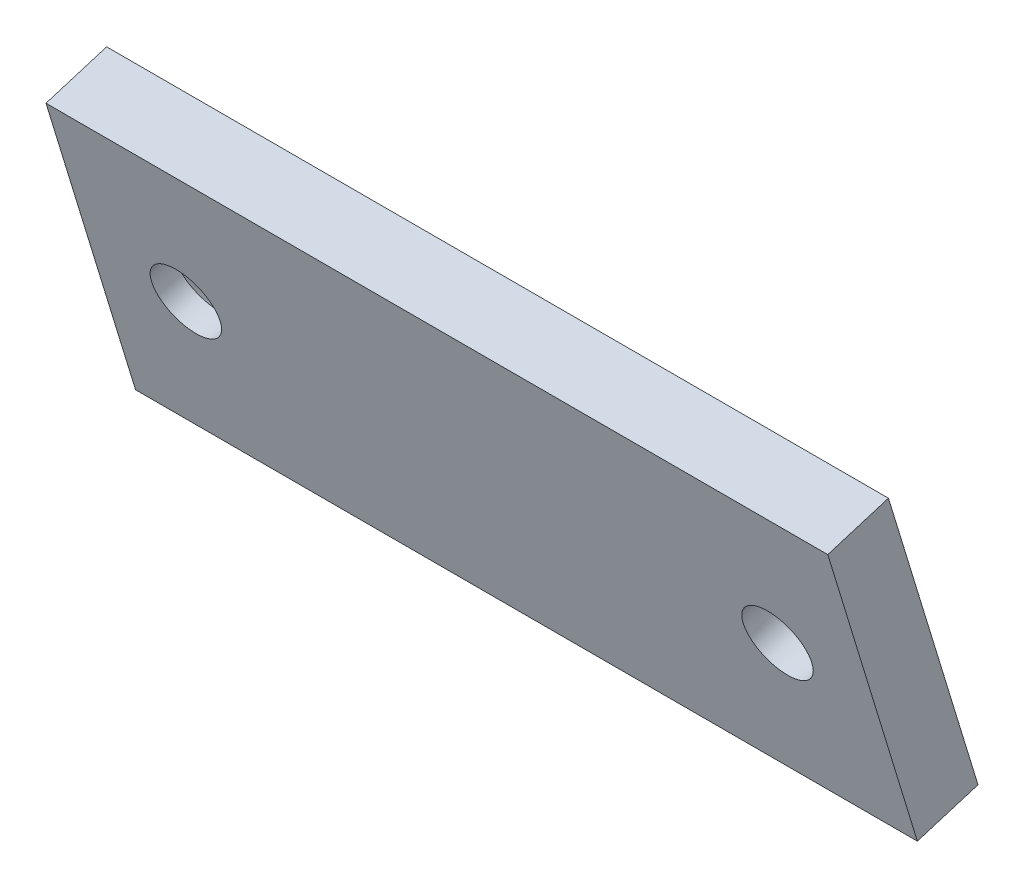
ISO-10303-21;
HEADER;
FILE_DESCRIPTION(('STEP AP214'),'2;1');
FILE_NAME('part.step','',(''),(''),'','','');
FILE_SCHEMA(('AUTOMOTIVE_DESIGN { 1 0 10303 214 1 1 1 1 }'));
ENDSEC;
DATA;
#1=APPLICATION_CONTEXT('core data for automotive mechanical design processes');
#2=APPLICATION_PROTOCOL_DEFINITION('international standard','automotive_design',2000,#1);
#3=PRODUCT_CONTEXT('',#1,'mechanical');
#4=PRODUCT('Part','Part','',(#3));
#5=PRODUCT_RELATED_PRODUCT_CATEGORY('part','',(#4));
#6=PRODUCT_DEFINITION_FORMATION('','',#4);
#7=PRODUCT_DEFINITION_CONTEXT('part definition',#1,'design');
#8=PRODUCT_DEFINITION('design','',#6,#7);
#9=PRODUCT_DEFINITION_SHAPE('','',#8);
#10=(LENGTH_UNIT() NAMED_UNIT(*) SI_UNIT(.MILLI.,.METRE.));
#11=(NAMED_UNIT(*) PLANE_ANGLE_UNIT() SI_UNIT($,.RADIAN.));
#12=(NAMED_UNIT(*) SI_UNIT($,.STERADIAN.) SOLID_ANGLE_UNIT());
#13=UNCERTAINTY_MEASURE_WITH_UNIT(LENGTH_MEASURE(1.E-05),#10,'distance_accuracy_value','');
#14=(GEOMETRIC_REPRESENTATION_CONTEXT(3) GLOBAL_UNCERTAINTY_ASSIGNED_CONTEXT((#13)) GLOBAL_UNIT_ASSIGNED_CONTEXT((#10,
#11,#12)) REPRESENTATION_CONTEXT('',''));
#15=CARTESIAN_POINT('',(0.,0.,0.));
#16=DIRECTION('',(0.,0.,1.));
#17=DIRECTION('',(1.,0.,0.));
#18=AXIS2_PLACEMENT_3D('',#15,#16,#17);
#19=CARTESIAN_POINT('',(-28.,-1.40281228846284,-68.5550265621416));
#20=DIRECTION('',(0.,0.292371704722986,-0.956304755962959));
#21=DIRECTION('',(0.,0.956304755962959,0.292371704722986));
#22=AXIS2_PLACEMENT_3D('',#19,#20,#21);
#23=CONICAL_SURFACE('',#22,3.25,0.785398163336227);
#24=CARTESIAN_POINT('',(-28.,-1.40281228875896,-68.5550265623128));
#25=DIRECTION('',(0.,0.292371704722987,-0.956304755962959));
#26=DIRECTION('',(0.,0.956304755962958,0.29237170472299));
#27=AXIS2_PLACEMENT_3D('',#24,#25,#26);
#28=CIRCLE('',#27,3.24999999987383);
#29=CARTESIAN_POINT('',(-28.,1.705178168,-67.604818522));
#30=VERTEX_POINT('',#29);
#31=EDGE_CURVE('E82',#30,#30,#28,.T.);
#32=ORIENTED_EDGE('',*,*,#31,.F.);
#33=EDGE_LOOP('',(#32));
#34=FACE_BOUND('',#33,.T.);
#35=CARTESIAN_POINT('',(-28.,-0.56955293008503,-71.2804951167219));
#36=DIRECTION('',(0.,0.292371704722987,-0.956304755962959));
#37=DIRECTION('',(0.,0.956304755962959,0.292371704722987));
#38=AXIS2_PLACEMENT_3D('',#35,#36,#37);
#39=CIRCLE('',#38,6.09999999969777);
#40=CARTESIAN_POINT('',(-28.,5.263906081,-69.497027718));
#41=VERTEX_POINT('',#40);
#42=EDGE_CURVE('E117',#41,#41,#39,.F.);
#43=ORIENTED_EDGE('',*,*,#42,.F.);
#44=EDGE_LOOP('',(#43));
#45=FACE_BOUND('',#44,.T.);
#46=ADVANCED_FACE('F24',(#34,#45),#23,.F.);
#47=CARTESIAN_POINT('',(-28.,-0.569552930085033,-71.2804951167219));
#48=DIRECTION('',(0.,0.292371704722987,-0.956304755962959));
#49=DIRECTION('',(0.,0.956304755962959,0.292371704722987));
#50=AXIS2_PLACEMENT_3D('',#47,#48,#49);
#51=CYLINDRICAL_SURFACE('',#50,6.09999999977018);
#52=ORIENTED_EDGE('',*,*,#42,.T.);
#53=EDGE_LOOP('',(#52));
#54=FACE_BOUND('',#53,.T.);
#55=CARTESIAN_POINT('',(-28.,-0.335655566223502,-72.0455389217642));
#56=DIRECTION('',(0.,0.292371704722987,-0.956304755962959));
#57=DIRECTION('',(0.,0.956304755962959,0.292371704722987));
#58=AXIS2_PLACEMENT_3D('',#55,#56,#57);
#59=CIRCLE('',#58,6.09999999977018);
#60=CARTESIAN_POINT('',(-28.,5.49780344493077,-70.2620715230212));
#61=VERTEX_POINT('',#60);
#62=EDGE_CURVE('E100',#61,#61,#59,.F.);
#63=ORIENTED_EDGE('',*,*,#62,.F.);
#64=EDGE_LOOP('',(#63));
#65=FACE_BOUND('',#64,.T.);
#66=ADVANCED_FACE('F156',(#54,#65),#51,.F.);
#67=CARTESIAN_POINT('',(37.,15.179460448,-66.796978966));
#68=DIRECTION('',(1.,0.,0.));
#69=DIRECTION('',(0.,-0.559192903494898,0.829037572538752));
#70=AXIS2_PLACEMENT_3D('',#67,#68,#69);
#71=PLANE('',#70);
#72=DIRECTION('',(0.,0.956304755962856,0.292371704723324));
#73=VECTOR('',#72,1.);
#74=CARTESIAN_POINT('',(37.,-2.0898857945,-66.3077103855));
#75=LINE('',#74,#73);
#76=CARTESIAN_POINT('',(37.,-15.9563047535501,-70.5471001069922));
#77=VERTEX_POINT('',#76);
#78=CARTESIAN_POINT('',(37.,11.7765331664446,-62.068320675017));
#79=VERTEX_POINT('',#78);
#80=EDGE_CURVE('E102',#77,#79,#75,.T.);
#81=ORIENTED_EDGE('',*,*,#80,.F.);
#82=DIRECTION('',(0.,0.292371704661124,-0.956304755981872));
#83=VECTOR('',#82,1.);
#84=CARTESIAN_POINT('',(37.,-15.079189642,-73.416014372));
#85=LINE('',#84,#83);
#86=CARTESIAN_POINT('',(37.,-14.2020745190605,-76.2849286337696));
#87=VERTEX_POINT('',#86);
#88=EDGE_CURVE('E112',#77,#87,#85,.T.);
#89=ORIENTED_EDGE('',*,*,#88,.T.);
#90=DIRECTION('',(0.,-0.956304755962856,-0.292371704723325));
#91=VECTOR('',#90,1.);
#92=CARTESIAN_POINT('',(37.,-0.335655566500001,-72.0455389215));
#93=LINE('',#92,#91);
#94=CARTESIAN_POINT('',(37.,13.5307633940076,-67.8061492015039));
#95=VERTEX_POINT('',#94);
#96=EDGE_CURVE('E86',#95,#87,#93,.T.);
#97=ORIENTED_EDGE('',*,*,#96,.F.);
#98=DIRECTION('',(0.,0.292371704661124,-0.956304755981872));
#99=VECTOR('',#98,1.);
#100=CARTESIAN_POINT('',(37.,12.653648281,-64.937234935));
#101=LINE('',#100,#99);
#102=EDGE_CURVE('E75',#79,#95,#101,.T.);
#103=ORIENTED_EDGE('',*,*,#102,.F.);
#104=EDGE_LOOP('',(#81,#89,#97,#103));
#105=FACE_BOUND('',#104,.T.);
#106=ADVANCED_FACE('F159',(#105),#71,.T.);
#107=CARTESIAN_POINT('',(-37.,13.530763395,-67.806149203));
#108=DIRECTION('',(0.,0.956304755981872,0.292371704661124));
#109=DIRECTION('',(0.,-0.292371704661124,0.956304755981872));
#110=AXIS2_PLACEMENT_3D('',#107,#108,#109);
#111=PLANE('',#110);
#112=DIRECTION('',(0.,0.292371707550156,-0.956304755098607));
#113=VECTOR('',#112,1.);
#114=CARTESIAN_POINT('',(-37.,11.7765331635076,-62.0683206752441));
#115=LINE('',#114,#113);
#116=CARTESIAN_POINT('',(-37.,11.7765331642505,-62.0683206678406));
#117=VERTEX_POINT('',#116);
#118=CARTESIAN_POINT('',(-37.,13.5307634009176,-67.8061492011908));
#119=VERTEX_POINT('',#118);
#120=EDGE_CURVE('E28',#117,#119,#115,.T.);
#121=ORIENTED_EDGE('',*,*,#120,.F.);
#122=DIRECTION('',(-1.,0.,0.));
#123=VECTOR('',#122,1.);
#124=CARTESIAN_POINT('',(0.,11.776533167,-62.068320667));
#125=LINE('',#124,#123);
#126=EDGE_CURVE('E105',#79,#117,#125,.T.);
#127=ORIENTED_EDGE('',*,*,#126,.F.);
#128=ORIENTED_EDGE('',*,*,#102,.T.);
#129=DIRECTION('',(1.,0.,0.));
#130=VECTOR('',#129,1.);
#131=CARTESIAN_POINT('',(0.,13.530763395,-67.806149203));
#132=LINE('',#131,#130);
#133=EDGE_CURVE('E79',#119,#95,#132,.T.);
#134=ORIENTED_EDGE('',*,*,#133,.F.);
#135=EDGE_LOOP('',(#121,#127,#128,#134));
#136=FACE_BOUND('',#135,.T.);
#137=ADVANCED_FACE('F84',(#136),#111,.T.);
#138=CARTESIAN_POINT('',(-37.,7.134236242,-54.869443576));
#139=DIRECTION('',(-1.,0.,0.));
#140=DIRECTION('',(0.,0.559192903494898,-0.829037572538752));
#141=AXIS2_PLACEMENT_3D('',#138,#139,#140);
#142=PLANE('',#141);
#143=DIRECTION('',(0.,0.956304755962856,0.292371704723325));
#144=VECTOR('',#143,1.);
#145=CARTESIAN_POINT('',(-37.,-0.335655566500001,-72.0455389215));
#146=LINE('',#145,#144);
#147=CARTESIAN_POINT('',(-37.,-14.2020745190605,-76.2849286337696));
#148=VERTEX_POINT('',#147);
#149=EDGE_CURVE('E71',#148,#119,#146,.T.);
#150=ORIENTED_EDGE('',*,*,#149,.F.);
#151=DIRECTION('',(0.,-0.292371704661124,0.956304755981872));
#152=VECTOR('',#151,1.);
#153=CARTESIAN_POINT('',(-37.,-15.079189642,-73.416014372));
#154=LINE('',#153,#152);
#155=CARTESIAN_POINT('',(-37.,-15.9563047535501,-70.5471001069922));
#156=VERTEX_POINT('',#155);
#157=EDGE_CURVE('E63',#148,#156,#154,.T.);
#158=ORIENTED_EDGE('',*,*,#157,.T.);
#159=DIRECTION('',(0.,-0.956304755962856,-0.292371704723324));
#160=VECTOR('',#159,1.);
#161=CARTESIAN_POINT('',(-37.,-2.0898857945,-66.3077103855));
#162=LINE('',#161,#160);
#163=EDGE_CURVE('E43',#117,#156,#162,.T.);
#164=ORIENTED_EDGE('',*,*,#163,.F.);
#165=ORIENTED_EDGE('',*,*,#120,.T.);
#166=EDGE_LOOP('',(#150,#158,#164,#165));
#167=FACE_BOUND('',#166,.T.);
#168=ADVANCED_FACE('F70',(#167),#142,.T.);
#169=CARTESIAN_POINT('',(-37.,-14.202074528,-76.28492864));
#170=DIRECTION('',(0.,0.956304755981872,0.292371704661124));
#171=DIRECTION('',(0.,-0.292371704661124,0.956304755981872));
#172=AXIS2_PLACEMENT_3D('',#169,#170,#171);
#173=PLANE('',#172);
#174=DIRECTION('',(1.,0.,0.));
#175=VECTOR('',#174,1.);
#176=CARTESIAN_POINT('',(0.,-15.956304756,-70.547100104));
#177=LINE('',#176,#175);
#178=EDGE_CURVE('E99',#156,#77,#177,.T.);
#179=ORIENTED_EDGE('',*,*,#178,.F.);
#180=ORIENTED_EDGE('',*,*,#157,.F.);
#181=DIRECTION('',(-1.,0.,0.));
#182=VECTOR('',#181,1.);
#183=CARTESIAN_POINT('',(0.,-14.202074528,-76.28492864));
#184=LINE('',#183,#182);
#185=EDGE_CURVE('E81',#87,#148,#184,.T.);
#186=ORIENTED_EDGE('',*,*,#185,.F.);
#187=ORIENTED_EDGE('',*,*,#88,.F.);
#188=EDGE_LOOP('',(#179,#180,#186,#187));
#189=FACE_BOUND('',#188,.T.);
#190=ADVANCED_FACE('F154',(#189),#173,.F.);
#191=CARTESIAN_POINT('',(-28.,-2.08988579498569,-66.3077103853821));
#192=DIRECTION('',(0.,0.292371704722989,-0.956304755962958));
#193=DIRECTION('',(0.,0.956304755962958,0.292371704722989));
#194=AXIS2_PLACEMENT_3D('',#191,#192,#193);
#195=CYLINDRICAL_SURFACE('',#194,3.24999999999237);
#196=CARTESIAN_POINT('',(-28.,-2.08988579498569,-66.3077103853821));
#197=DIRECTION('',(0.,0.292371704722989,-0.956304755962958));
#198=DIRECTION('',(0.,0.956304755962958,0.292371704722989));
#199=AXIS2_PLACEMENT_3D('',#196,#197,#198);
#200=CIRCLE('',#199,3.24999999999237);
#201=CARTESIAN_POINT('',(-28.,1.01810466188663,-65.3575023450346));
#202=VERTEX_POINT('',#201);
#203=EDGE_CURVE('E97',#202,#202,#200,.T.);
#204=ORIENTED_EDGE('',*,*,#203,.F.);
#205=EDGE_LOOP('',(#204));
#206=FACE_BOUND('',#205,.T.);
#207=ORIENTED_EDGE('',*,*,#31,.T.);
#208=EDGE_LOOP('',(#207));
#209=FACE_BOUND('',#208,.T.);
#210=ADVANCED_FACE('F145',(#206,#209),#195,.F.);
#211=CARTESIAN_POINT('',(-37.,13.530763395,-67.806149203));
#212=DIRECTION('',(0.,0.292371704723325,-0.956304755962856));
#213=DIRECTION('',(1.,0.,0.));
#214=AXIS2_PLACEMENT_3D('',#211,#212,#213);
#215=PLANE('',#214);
#216=ORIENTED_EDGE('',*,*,#62,.T.);
#217=EDGE_LOOP('',(#216));
#218=FACE_BOUND('',#217,.T.);
#219=CARTESIAN_POINT('',(28.,-0.335655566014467,-72.0455389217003));
#220=DIRECTION('',(0.,0.292371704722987,-0.956304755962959));
#221=DIRECTION('',(0.,0.956304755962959,0.292371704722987));
#222=AXIS2_PLACEMENT_3D('',#219,#220,#221);
#223=CIRCLE('',#222,6.09999999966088);
#224=CARTESIAN_POINT('',(28.,5.49780344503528,-70.2620715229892));
#225=VERTEX_POINT('',#224);
#226=EDGE_CURVE('E94',#225,#225,#223,.T.);
#227=ORIENTED_EDGE('',*,*,#226,.F.);
#228=EDGE_LOOP('',(#227));
#229=FACE_BOUND('',#228,.T.);
#230=ORIENTED_EDGE('',*,*,#96,.T.);
#231=ORIENTED_EDGE('',*,*,#185,.T.);
#232=ORIENTED_EDGE('',*,*,#149,.T.);
#233=ORIENTED_EDGE('',*,*,#133,.T.);
#234=EDGE_LOOP('',(#230,#231,#232,#233));
#235=FACE_BOUND('',#234,.T.);
#236=ADVANCED_FACE('F78',(#218,#229,#235),#215,.T.);
#237=CARTESIAN_POINT('',(-37.,-15.956304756,-70.547100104));
#238=DIRECTION('',(0.,-0.292371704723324,0.956304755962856));
#239=DIRECTION('',(1.,0.,0.));
#240=AXIS2_PLACEMENT_3D('',#237,#238,#239);
#241=PLANE('',#240);
#242=ORIENTED_EDGE('',*,*,#203,.T.);
#243=EDGE_LOOP('',(#242));
#244=FACE_BOUND('',#243,.T.);
#245=CARTESIAN_POINT('',(28.,-2.08988579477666,-66.3077103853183));
#246=DIRECTION('',(0.,0.292371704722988,-0.956304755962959));
#247=DIRECTION('',(0.,0.956304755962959,0.292371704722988));
#248=AXIS2_PLACEMENT_3D('',#245,#246,#247);
#249=CIRCLE('',#248,3.24999999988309);
#250=CARTESIAN_POINT('',(28.,1.01810466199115,-65.3575023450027));
#251=VERTEX_POINT('',#250);
#252=EDGE_CURVE('E91',#251,#251,#249,.F.);
#253=ORIENTED_EDGE('',*,*,#252,.F.);
#254=EDGE_LOOP('',(#253));
#255=FACE_BOUND('',#254,.T.);
#256=ORIENTED_EDGE('',*,*,#163,.T.);
#257=ORIENTED_EDGE('',*,*,#178,.T.);
#258=ORIENTED_EDGE('',*,*,#80,.T.);
#259=ORIENTED_EDGE('',*,*,#126,.T.);
#260=EDGE_LOOP('',(#256,#257,#258,#259));
#261=FACE_BOUND('',#260,.T.);
#262=ADVANCED_FACE('F26',(#244,#255,#261),#241,.T.);
#263=CARTESIAN_POINT('',(28.,-0.452604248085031,-71.6630170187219));
#264=DIRECTION('',(0.,0.292371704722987,-0.956304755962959));
#265=DIRECTION('',(0.,0.956304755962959,0.292371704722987));
#266=AXIS2_PLACEMENT_3D('',#263,#264,#265);
#267=CYLINDRICAL_SURFACE('',#266,6.09999999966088);
#268=ORIENTED_EDGE('',*,*,#226,.T.);
#269=EDGE_LOOP('',(#268));
#270=FACE_BOUND('',#269,.T.);
#271=CARTESIAN_POINT('',(28.,-0.452604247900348,-71.6630170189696));
#272=DIRECTION('',(0.,0.292371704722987,-0.956304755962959));
#273=DIRECTION('',(-1.,-1.6336331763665E-11,-4.98690342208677E-12));
#274=AXIS2_PLACEMENT_3D('',#271,#272,#273);
#275=CIRCLE('',#274,6.1);
#276=CARTESIAN_POINT('',(21.9,-0.452604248,-71.663017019));
#277=VERTEX_POINT('',#276);
#278=EDGE_CURVE('E13',#277,#277,#275,.T.);
#279=ORIENTED_EDGE('',*,*,#278,.F.);
#280=EDGE_LOOP('',(#279));
#281=FACE_BOUND('',#280,.T.);
#282=ADVANCED_FACE('F132',(#270,#281),#267,.F.);
#283=CARTESIAN_POINT('',(28.,-2.08988579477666,-66.3077103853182));
#284=DIRECTION('',(0.,0.292371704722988,-0.956304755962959));
#285=DIRECTION('',(0.,0.956304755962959,0.292371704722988));
#286=AXIS2_PLACEMENT_3D('',#283,#284,#285);
#287=CYLINDRICAL_SURFACE('',#286,3.24999999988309);
#288=CARTESIAN_POINT('',(28.,-1.28586360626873,-68.9375484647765));
#289=DIRECTION('',(0.,0.292371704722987,-0.956304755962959));
#290=DIRECTION('',(-1.,-2.25006711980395E-10,-6.87825864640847E-11));
#291=AXIS2_PLACEMENT_3D('',#288,#289,#290);
#292=CIRCLE('',#291,3.25);
#293=CARTESIAN_POINT('',(24.75,-1.285863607,-68.937548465));
#294=VERTEX_POINT('',#293);
#295=EDGE_CURVE('E34',#294,#294,#292,.F.);
#296=ORIENTED_EDGE('',*,*,#295,.F.);
#297=EDGE_LOOP('',(#296));
#298=FACE_BOUND('',#297,.T.);
#299=ORIENTED_EDGE('',*,*,#252,.T.);
#300=EDGE_LOOP('',(#299));
#301=FACE_BOUND('',#300,.T.);
#302=ADVANCED_FACE('F129',(#298,#301),#287,.F.);
#303=CARTESIAN_POINT('',(28.,-1.28586360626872,-68.9375484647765));
#304=DIRECTION('',(0.,0.292371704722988,-0.956304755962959));
#305=DIRECTION('',(0.,0.956304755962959,0.292371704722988));
#306=AXIS2_PLACEMENT_3D('',#303,#304,#305);
#307=CONICAL_SURFACE('',#306,3.25,0.785398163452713);
#308=ORIENTED_EDGE('',*,*,#278,.T.);
#309=EDGE_LOOP('',(#308));
#310=FACE_BOUND('',#309,.T.);
#311=ORIENTED_EDGE('',*,*,#295,.T.);
#312=EDGE_LOOP('',(#311));
#313=FACE_BOUND('',#312,.T.);
#314=ADVANCED_FACE('F127',(#310,#313),#307,.F.);
#315=CLOSED_SHELL('',(#46,#66,#106,#137,#168,#190,#210,#236,#262,#282,#302,#314));
#316=MANIFOLD_SOLID_BREP('B1',#315);
#317=ADVANCED_BREP_SHAPE_REPRESENTATION('',(#18,#316),#14);
#318=SHAPE_DEFINITION_REPRESENTATION(#9,#317);
ENDSEC;
END-ISO-10303-21;
